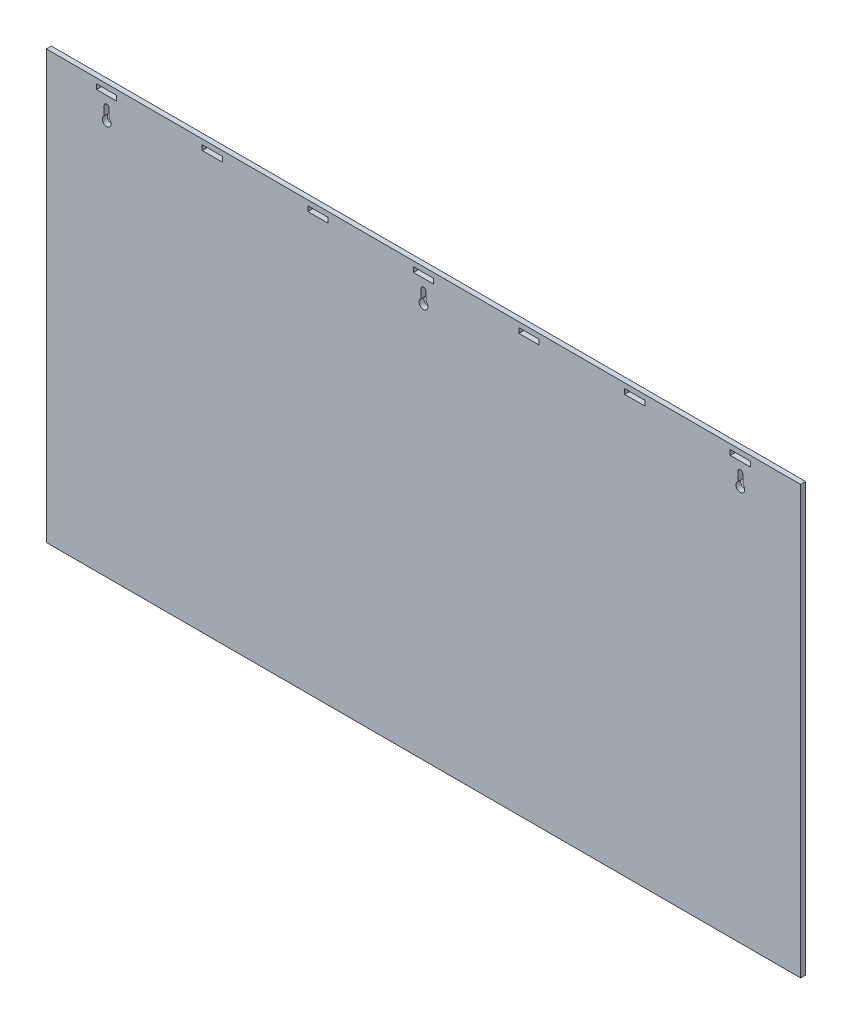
ISO-10303-21;
HEADER;
FILE_DESCRIPTION(('STEP AP214'),'2;1');
FILE_NAME('part.step','',(''),(''),'','','');
FILE_SCHEMA(('AUTOMOTIVE_DESIGN { 1 0 10303 214 1 1 1 1 }'));
ENDSEC;
DATA;
#1=APPLICATION_CONTEXT('core data for automotive mechanical design processes');
#2=APPLICATION_PROTOCOL_DEFINITION('international standard','automotive_design',2000,#1);
#3=PRODUCT_CONTEXT('',#1,'mechanical');
#4=PRODUCT('Part','Part','',(#3));
#5=PRODUCT_RELATED_PRODUCT_CATEGORY('part','',(#4));
#6=PRODUCT_DEFINITION_FORMATION('','',#4);
#7=PRODUCT_DEFINITION_CONTEXT('part definition',#1,'design');
#8=PRODUCT_DEFINITION('design','',#6,#7);
#9=PRODUCT_DEFINITION_SHAPE('','',#8);
#10=(LENGTH_UNIT() NAMED_UNIT(*) SI_UNIT(.MILLI.,.METRE.));
#11=(NAMED_UNIT(*) PLANE_ANGLE_UNIT() SI_UNIT($,.RADIAN.));
#12=(NAMED_UNIT(*) SI_UNIT($,.STERADIAN.) SOLID_ANGLE_UNIT());
#13=UNCERTAINTY_MEASURE_WITH_UNIT(LENGTH_MEASURE(1.E-05),#10,'distance_accuracy_value','');
#14=(GEOMETRIC_REPRESENTATION_CONTEXT(3) GLOBAL_UNCERTAINTY_ASSIGNED_CONTEXT((#13)) GLOBAL_UNIT_ASSIGNED_CONTEXT((#10,
#11,#12)) REPRESENTATION_CONTEXT('',''));
#15=CARTESIAN_POINT('',(0.,0.,0.));
#16=DIRECTION('',(0.,0.,1.));
#17=DIRECTION('',(1.,0.,0.));
#18=AXIS2_PLACEMENT_3D('',#15,#16,#17);
#19=CARTESIAN_POINT('',(0.,539.75,6.35));
#20=DIRECTION('',(0.,1.,0.));
#21=DIRECTION('',(0.,0.,1.));
#22=AXIS2_PLACEMENT_3D('',#19,#20,#21);
#23=PLANE('',#22);
#24=DIRECTION('',(1.,0.,0.));
#25=VECTOR('',#24,1.);
#26=CARTESIAN_POINT('',(0.,539.75,0.));
#27=LINE('',#26,#25);
#28=CARTESIAN_POINT('',(2.50423082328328E-06,539.749997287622,0.));
#29=VERTEX_POINT('',#28);
#30=CARTESIAN_POINT('',(952.5,539.75,0.));
#31=VERTEX_POINT('',#30);
#32=EDGE_CURVE('E471',#29,#31,#27,.T.);
#33=ORIENTED_EDGE('',*,*,#32,.F.);
#34=DIRECTION('',(0.,0.,-1.));
#35=VECTOR('',#34,1.);
#36=CARTESIAN_POINT('',(2.50423082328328E-06,539.749997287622,6.35));
#37=LINE('',#36,#35);
#38=CARTESIAN_POINT('',(2.50423082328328E-06,539.749997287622,6.35));
#39=VERTEX_POINT('',#38);
#40=EDGE_CURVE('E11',#39,#29,#37,.T.);
#41=ORIENTED_EDGE('',*,*,#40,.F.);
#42=DIRECTION('',(1.,0.,0.));
#43=VECTOR('',#42,1.);
#44=CARTESIAN_POINT('',(0.,539.75,6.35));
#45=LINE('',#44,#43);
#46=CARTESIAN_POINT('',(952.5,539.75,6.35));
#47=VERTEX_POINT('',#46);
#48=EDGE_CURVE('E343',#39,#47,#45,.T.);
#49=ORIENTED_EDGE('',*,*,#48,.T.);
#50=DIRECTION('',(0.,0.,-1.));
#51=VECTOR('',#50,1.);
#52=CARTESIAN_POINT('',(952.5,539.75,6.35));
#53=LINE('',#52,#51);
#54=EDGE_CURVE('E197',#47,#31,#53,.T.);
#55=ORIENTED_EDGE('',*,*,#54,.T.);
#56=EDGE_LOOP('',(#33,#41,#49,#55));
#57=FACE_BOUND('',#56,.T.);
#58=ADVANCED_FACE('F35',(#57),#23,.T.);
#59=CARTESIAN_POINT('',(0.,0.,6.35));
#60=DIRECTION('',(-1.,0.,0.));
#61=DIRECTION('',(0.,0.,1.));
#62=AXIS2_PLACEMENT_3D('',#59,#60,#61);
#63=PLANE('',#62);
#64=DIRECTION('',(0.,1.,0.));
#65=VECTOR('',#64,1.);
#66=CARTESIAN_POINT('',(0.,0.,0.));
#67=LINE('',#66,#65);
#68=CARTESIAN_POINT('',(0.,0.,0.));
#69=VERTEX_POINT('',#68);
#70=EDGE_CURVE('E333',#69,#29,#67,.T.);
#71=ORIENTED_EDGE('',*,*,#70,.F.);
#72=DIRECTION('',(0.,0.,-1.));
#73=VECTOR('',#72,1.);
#74=CARTESIAN_POINT('',(0.,0.,6.35));
#75=LINE('',#74,#73);
#76=CARTESIAN_POINT('',(0.,0.,6.35));
#77=VERTEX_POINT('',#76);
#78=EDGE_CURVE('E45',#77,#69,#75,.T.);
#79=ORIENTED_EDGE('',*,*,#78,.F.);
#80=DIRECTION('',(0.,1.,0.));
#81=VECTOR('',#80,1.);
#82=CARTESIAN_POINT('',(0.,0.,6.35));
#83=LINE('',#82,#81);
#84=EDGE_CURVE('E331',#77,#39,#83,.T.);
#85=ORIENTED_EDGE('',*,*,#84,.T.);
#86=ORIENTED_EDGE('',*,*,#40,.T.);
#87=EDGE_LOOP('',(#71,#79,#85,#86));
#88=FACE_BOUND('',#87,.T.);
#89=ADVANCED_FACE('F329',(#88),#63,.T.);
#90=CARTESIAN_POINT('',(0.,0.,6.35));
#91=DIRECTION('',(0.,1.,0.));
#92=DIRECTION('',(0.,0.,1.));
#93=AXIS2_PLACEMENT_3D('',#90,#91,#92);
#94=PLANE('',#93);
#95=DIRECTION('',(1.,0.,0.));
#96=VECTOR('',#95,1.);
#97=CARTESIAN_POINT('',(0.,0.,0.));
#98=LINE('',#97,#96);
#99=CARTESIAN_POINT('',(952.5,0.,0.));
#100=VERTEX_POINT('',#99);
#101=EDGE_CURVE('E474',#69,#100,#98,.T.);
#102=ORIENTED_EDGE('',*,*,#101,.T.);
#103=DIRECTION('',(0.,0.,-1.));
#104=VECTOR('',#103,1.);
#105=CARTESIAN_POINT('',(952.5,0.,6.35));
#106=LINE('',#105,#104);
#107=CARTESIAN_POINT('',(952.5,0.,6.35));
#108=VERTEX_POINT('',#107);
#109=EDGE_CURVE('E336',#108,#100,#106,.T.);
#110=ORIENTED_EDGE('',*,*,#109,.F.);
#111=DIRECTION('',(1.,0.,0.));
#112=VECTOR('',#111,1.);
#113=CARTESIAN_POINT('',(0.,0.,6.35));
#114=LINE('',#113,#112);
#115=EDGE_CURVE('E339',#77,#108,#114,.T.);
#116=ORIENTED_EDGE('',*,*,#115,.F.);
#117=ORIENTED_EDGE('',*,*,#78,.T.);
#118=EDGE_LOOP('',(#102,#110,#116,#117));
#119=FACE_BOUND('',#118,.T.);
#120=ADVANCED_FACE('F340',(#119),#94,.F.);
#121=CARTESIAN_POINT('',(76.2000025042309,498.474997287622,6.35));
#122=DIRECTION('',(0.,0.,-1.));
#123=DIRECTION('',(-1.,0.,0.));
#124=AXIS2_PLACEMENT_3D('',#121,#122,#123);
#125=CYLINDRICAL_SURFACE('',#124,5.55624999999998);
#126=CARTESIAN_POINT('',(76.2000025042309,498.474997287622,0.));
#127=DIRECTION('',(0.,0.,1.));
#128=DIRECTION('',(1.,0.,0.));
#129=AXIS2_PLACEMENT_3D('',#126,#127,#128);
#130=CIRCLE('',#129,5.55624999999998);
#131=CARTESIAN_POINT('',(73.0250025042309,503.034743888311,0.));
#132=VERTEX_POINT('',#131);
#133=CARTESIAN_POINT('',(79.3750025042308,503.034743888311,0.));
#134=VERTEX_POINT('',#133);
#135=EDGE_CURVE('E459',#132,#134,#130,.T.);
#136=ORIENTED_EDGE('',*,*,#135,.F.);
#137=DIRECTION('',(0.,0.,-1.));
#138=VECTOR('',#137,1.);
#139=CARTESIAN_POINT('',(73.0250025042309,503.034743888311,6.35));
#140=LINE('',#139,#138);
#141=CARTESIAN_POINT('',(73.0250025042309,503.034743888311,6.35));
#142=VERTEX_POINT('',#141);
#143=EDGE_CURVE('E479',#142,#132,#140,.T.);
#144=ORIENTED_EDGE('',*,*,#143,.F.);
#145=CARTESIAN_POINT('',(76.2000025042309,498.474997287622,6.35));
#146=DIRECTION('',(0.,0.,1.));
#147=DIRECTION('',(1.,0.,0.));
#148=AXIS2_PLACEMENT_3D('',#145,#146,#147);
#149=CIRCLE('',#148,5.55624999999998);
#150=CARTESIAN_POINT('',(79.3750025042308,503.034743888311,6.35));
#151=VERTEX_POINT('',#150);
#152=EDGE_CURVE('E678',#142,#151,#149,.T.);
#153=ORIENTED_EDGE('',*,*,#152,.T.);
#154=DIRECTION('',(0.,0.,-1.));
#155=VECTOR('',#154,1.);
#156=CARTESIAN_POINT('',(79.3750025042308,503.034743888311,6.35));
#157=LINE('',#156,#155);
#158=EDGE_CURVE('E481',#151,#134,#157,.T.);
#159=ORIENTED_EDGE('',*,*,#158,.T.);
#160=EDGE_LOOP('',(#136,#144,#153,#159));
#161=FACE_BOUND('',#160,.T.);
#162=ADVANCED_FACE('F702',(#161),#125,.F.);
#163=CARTESIAN_POINT('',(73.0250025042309,0.,6.35));
#164=DIRECTION('',(1.,0.,0.));
#165=DIRECTION('',(0.,0.,-1.));
#166=AXIS2_PLACEMENT_3D('',#163,#164,#165);
#167=PLANE('',#166);
#168=DIRECTION('',(0.,-1.,0.));
#169=VECTOR('',#168,1.);
#170=CARTESIAN_POINT('',(73.0250025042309,0.,0.));
#171=LINE('',#170,#169);
#172=CARTESIAN_POINT('',(73.0250025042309,514.349997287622,0.));
#173=VERTEX_POINT('',#172);
#174=EDGE_CURVE('E462',#173,#132,#171,.T.);
#175=ORIENTED_EDGE('',*,*,#174,.F.);
#176=DIRECTION('',(0.,0.,-1.));
#177=VECTOR('',#176,1.);
#178=CARTESIAN_POINT('',(73.0250025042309,514.349997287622,6.35));
#179=LINE('',#178,#177);
#180=CARTESIAN_POINT('',(73.0250025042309,514.349997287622,6.35));
#181=VERTEX_POINT('',#180);
#182=EDGE_CURVE('E486',#181,#173,#179,.T.);
#183=ORIENTED_EDGE('',*,*,#182,.F.);
#184=DIRECTION('',(0.,-1.,0.));
#185=VECTOR('',#184,1.);
#186=CARTESIAN_POINT('',(73.0250025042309,0.,6.35));
#187=LINE('',#186,#185);
#188=EDGE_CURVE('E681',#181,#142,#187,.T.);
#189=ORIENTED_EDGE('',*,*,#188,.T.);
#190=ORIENTED_EDGE('',*,*,#143,.T.);
#191=EDGE_LOOP('',(#175,#183,#189,#190));
#192=FACE_BOUND('',#191,.T.);
#193=ADVANCED_FACE('F704',(#192),#167,.T.);
#194=CARTESIAN_POINT('',(76.2000025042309,514.349997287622,6.35));
#195=DIRECTION('',(0.,0.,-1.));
#196=DIRECTION('',(-1.,0.,0.));
#197=AXIS2_PLACEMENT_3D('',#194,#195,#196);
#198=CYLINDRICAL_SURFACE('',#197,3.17499999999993);
#199=CARTESIAN_POINT('',(76.2000025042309,514.349997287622,0.));
#200=DIRECTION('',(0.,0.,1.));
#201=DIRECTION('',(1.,0.,0.));
#202=AXIS2_PLACEMENT_3D('',#199,#200,#201);
#203=CIRCLE('',#202,3.17499999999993);
#204=CARTESIAN_POINT('',(79.3750025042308,514.349997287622,0.));
#205=VERTEX_POINT('',#204);
#206=EDGE_CURVE('E465',#205,#173,#203,.T.);
#207=ORIENTED_EDGE('',*,*,#206,.F.);
#208=DIRECTION('',(0.,0.,-1.));
#209=VECTOR('',#208,1.);
#210=CARTESIAN_POINT('',(79.3750025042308,514.349997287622,6.35));
#211=LINE('',#210,#209);
#212=CARTESIAN_POINT('',(79.3750025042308,514.349997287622,6.35));
#213=VERTEX_POINT('',#212);
#214=EDGE_CURVE('E483',#213,#205,#211,.T.);
#215=ORIENTED_EDGE('',*,*,#214,.F.);
#216=CARTESIAN_POINT('',(76.2000025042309,514.349997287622,6.35));
#217=DIRECTION('',(0.,0.,1.));
#218=DIRECTION('',(1.,0.,0.));
#219=AXIS2_PLACEMENT_3D('',#216,#217,#218);
#220=CIRCLE('',#219,3.17499999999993);
#221=EDGE_CURVE('E684',#213,#181,#220,.T.);
#222=ORIENTED_EDGE('',*,*,#221,.T.);
#223=ORIENTED_EDGE('',*,*,#182,.T.);
#224=EDGE_LOOP('',(#207,#215,#222,#223));
#225=FACE_BOUND('',#224,.T.);
#226=ADVANCED_FACE('F697',(#225),#198,.F.);
#227=CARTESIAN_POINT('',(476.250001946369,498.475031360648,6.35));
#228=DIRECTION('',(0.,0.,-1.));
#229=DIRECTION('',(-1.,0.,0.));
#230=AXIS2_PLACEMENT_3D('',#227,#228,#229);
#231=CYLINDRICAL_SURFACE('',#230,5.55624999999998);
#232=CARTESIAN_POINT('',(476.250001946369,498.475031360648,0.));
#233=DIRECTION('',(0.,0.,1.));
#234=DIRECTION('',(1.,0.,0.));
#235=AXIS2_PLACEMENT_3D('',#232,#233,#234);
#236=CIRCLE('',#235,5.55624999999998);
#237=CARTESIAN_POINT('',(473.075001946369,503.034777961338,0.));
#238=VERTEX_POINT('',#237);
#239=CARTESIAN_POINT('',(479.425001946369,503.034777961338,0.));
#240=VERTEX_POINT('',#239);
#241=EDGE_CURVE('E447',#238,#240,#236,.T.);
#242=ORIENTED_EDGE('',*,*,#241,.F.);
#243=DIRECTION('',(0.,0.,-1.));
#244=VECTOR('',#243,1.);
#245=CARTESIAN_POINT('',(473.075001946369,503.034777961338,6.35));
#246=LINE('',#245,#244);
#247=CARTESIAN_POINT('',(473.075001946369,503.034777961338,6.35));
#248=VERTEX_POINT('',#247);
#249=EDGE_CURVE('E484',#248,#238,#246,.T.);
#250=ORIENTED_EDGE('',*,*,#249,.F.);
#251=CARTESIAN_POINT('',(476.250001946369,498.475031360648,6.35));
#252=DIRECTION('',(0.,0.,1.));
#253=DIRECTION('',(1.,0.,0.));
#254=AXIS2_PLACEMENT_3D('',#251,#252,#253);
#255=CIRCLE('',#254,5.55624999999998);
#256=CARTESIAN_POINT('',(479.425001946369,503.034777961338,6.35));
#257=VERTEX_POINT('',#256);
#258=EDGE_CURVE('E666',#248,#257,#255,.T.);
#259=ORIENTED_EDGE('',*,*,#258,.T.);
#260=DIRECTION('',(0.,0.,-1.));
#261=VECTOR('',#260,1.);
#262=CARTESIAN_POINT('',(479.425001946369,503.034777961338,6.35));
#263=LINE('',#262,#261);
#264=EDGE_CURVE('E489',#257,#240,#263,.T.);
#265=ORIENTED_EDGE('',*,*,#264,.T.);
#266=EDGE_LOOP('',(#242,#250,#259,#265));
#267=FACE_BOUND('',#266,.T.);
#268=ADVANCED_FACE('F711',(#267),#231,.F.);
#269=CARTESIAN_POINT('',(473.075001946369,0.,6.35));
#270=DIRECTION('',(1.,0.,0.));
#271=DIRECTION('',(0.,0.,-1.));
#272=AXIS2_PLACEMENT_3D('',#269,#270,#271);
#273=PLANE('',#272);
#274=DIRECTION('',(0.,-1.,0.));
#275=VECTOR('',#274,1.);
#276=CARTESIAN_POINT('',(473.075001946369,0.,0.));
#277=LINE('',#276,#275);
#278=CARTESIAN_POINT('',(473.075001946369,514.350031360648,0.));
#279=VERTEX_POINT('',#278);
#280=EDGE_CURVE('E450',#279,#238,#277,.T.);
#281=ORIENTED_EDGE('',*,*,#280,.F.);
#282=DIRECTION('',(0.,0.,-1.));
#283=VECTOR('',#282,1.);
#284=CARTESIAN_POINT('',(473.075001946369,514.350031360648,6.35));
#285=LINE('',#284,#283);
#286=CARTESIAN_POINT('',(473.075001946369,514.350031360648,6.35));
#287=VERTEX_POINT('',#286);
#288=EDGE_CURVE('E494',#287,#279,#285,.T.);
#289=ORIENTED_EDGE('',*,*,#288,.F.);
#290=DIRECTION('',(0.,-1.,0.));
#291=VECTOR('',#290,1.);
#292=CARTESIAN_POINT('',(473.075001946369,0.,6.35));
#293=LINE('',#292,#291);
#294=EDGE_CURVE('E669',#287,#248,#293,.T.);
#295=ORIENTED_EDGE('',*,*,#294,.T.);
#296=ORIENTED_EDGE('',*,*,#249,.T.);
#297=EDGE_LOOP('',(#281,#289,#295,#296));
#298=FACE_BOUND('',#297,.T.);
#299=ADVANCED_FACE('F853',(#298),#273,.T.);
#300=CARTESIAN_POINT('',(476.250001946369,514.350031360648,6.35));
#301=DIRECTION('',(0.,0.,-1.));
#302=DIRECTION('',(-1.,0.,0.));
#303=AXIS2_PLACEMENT_3D('',#300,#301,#302);
#304=CYLINDRICAL_SURFACE('',#303,3.17499999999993);
#305=CARTESIAN_POINT('',(476.250001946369,514.350031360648,0.));
#306=DIRECTION('',(0.,0.,1.));
#307=DIRECTION('',(1.,0.,0.));
#308=AXIS2_PLACEMENT_3D('',#305,#306,#307);
#309=CIRCLE('',#308,3.17499999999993);
#310=CARTESIAN_POINT('',(479.425001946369,514.350031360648,0.));
#311=VERTEX_POINT('',#310);
#312=EDGE_CURVE('E453',#311,#279,#309,.T.);
#313=ORIENTED_EDGE('',*,*,#312,.F.);
#314=DIRECTION('',(0.,0.,-1.));
#315=VECTOR('',#314,1.);
#316=CARTESIAN_POINT('',(479.425001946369,514.350031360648,6.35));
#317=LINE('',#316,#315);
#318=CARTESIAN_POINT('',(479.425001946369,514.350031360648,6.35));
#319=VERTEX_POINT('',#318);
#320=EDGE_CURVE('E491',#319,#311,#317,.T.);
#321=ORIENTED_EDGE('',*,*,#320,.F.);
#322=CARTESIAN_POINT('',(476.250001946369,514.350031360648,6.35));
#323=DIRECTION('',(0.,0.,1.));
#324=DIRECTION('',(1.,0.,0.));
#325=AXIS2_PLACEMENT_3D('',#322,#323,#324);
#326=CIRCLE('',#325,3.17499999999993);
#327=EDGE_CURVE('E672',#319,#287,#326,.T.);
#328=ORIENTED_EDGE('',*,*,#327,.T.);
#329=ORIENTED_EDGE('',*,*,#288,.T.);
#330=EDGE_LOOP('',(#313,#321,#328,#329));
#331=FACE_BOUND('',#330,.T.);
#332=ADVANCED_FACE('F840',(#331),#304,.F.);
#333=CARTESIAN_POINT('',(876.299985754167,498.474870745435,6.35));
#334=DIRECTION('',(0.,0.,-1.));
#335=DIRECTION('',(-1.,0.,0.));
#336=AXIS2_PLACEMENT_3D('',#333,#334,#335);
#337=CYLINDRICAL_SURFACE('',#336,5.55624999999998);
#338=CARTESIAN_POINT('',(876.299985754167,498.474870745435,0.));
#339=DIRECTION('',(0.,0.,1.));
#340=DIRECTION('',(1.,0.,0.));
#341=AXIS2_PLACEMENT_3D('',#338,#339,#340);
#342=CIRCLE('',#341,5.55624999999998);
#343=CARTESIAN_POINT('',(873.124985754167,503.034617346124,0.));
#344=VERTEX_POINT('',#343);
#345=CARTESIAN_POINT('',(879.474985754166,503.034617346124,0.));
#346=VERTEX_POINT('',#345);
#347=EDGE_CURVE('E435',#344,#346,#342,.T.);
#348=ORIENTED_EDGE('',*,*,#347,.F.);
#349=DIRECTION('',(0.,0.,-1.));
#350=VECTOR('',#349,1.);
#351=CARTESIAN_POINT('',(873.124985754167,503.034617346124,6.35));
#352=LINE('',#351,#350);
#353=CARTESIAN_POINT('',(873.124985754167,503.034617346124,6.35));
#354=VERTEX_POINT('',#353);
#355=EDGE_CURVE('E492',#354,#344,#352,.T.);
#356=ORIENTED_EDGE('',*,*,#355,.F.);
#357=CARTESIAN_POINT('',(876.299985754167,498.474870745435,6.35));
#358=DIRECTION('',(0.,0.,1.));
#359=DIRECTION('',(1.,0.,0.));
#360=AXIS2_PLACEMENT_3D('',#357,#358,#359);
#361=CIRCLE('',#360,5.55624999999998);
#362=CARTESIAN_POINT('',(879.474985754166,503.034617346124,6.35));
#363=VERTEX_POINT('',#362);
#364=EDGE_CURVE('E654',#354,#363,#361,.T.);
#365=ORIENTED_EDGE('',*,*,#364,.T.);
#366=DIRECTION('',(0.,0.,-1.));
#367=VECTOR('',#366,1.);
#368=CARTESIAN_POINT('',(879.474985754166,503.034617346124,6.35));
#369=LINE('',#368,#367);
#370=EDGE_CURVE('E497',#363,#346,#369,.T.);
#371=ORIENTED_EDGE('',*,*,#370,.T.);
#372=EDGE_LOOP('',(#348,#356,#365,#371));
#373=FACE_BOUND('',#372,.T.);
#374=ADVANCED_FACE('F836',(#373),#337,.F.);
#375=CARTESIAN_POINT('',(873.124985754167,0.,6.35));
#376=DIRECTION('',(1.,0.,0.));
#377=DIRECTION('',(0.,0.,-1.));
#378=AXIS2_PLACEMENT_3D('',#375,#376,#377);
#379=PLANE('',#378);
#380=DIRECTION('',(0.,-1.,0.));
#381=VECTOR('',#380,1.);
#382=CARTESIAN_POINT('',(873.124985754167,0.,0.));
#383=LINE('',#382,#381);
#384=CARTESIAN_POINT('',(873.124985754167,514.349870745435,0.));
#385=VERTEX_POINT('',#384);
#386=EDGE_CURVE('E438',#385,#344,#383,.T.);
#387=ORIENTED_EDGE('',*,*,#386,.F.);
#388=DIRECTION('',(0.,0.,-1.));
#389=VECTOR('',#388,1.);
#390=CARTESIAN_POINT('',(873.124985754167,514.349870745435,6.35));
#391=LINE('',#390,#389);
#392=CARTESIAN_POINT('',(873.124985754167,514.349870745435,6.35));
#393=VERTEX_POINT('',#392);
#394=EDGE_CURVE('E502',#393,#385,#391,.T.);
#395=ORIENTED_EDGE('',*,*,#394,.F.);
#396=DIRECTION('',(0.,-1.,0.));
#397=VECTOR('',#396,1.);
#398=CARTESIAN_POINT('',(873.124985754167,0.,6.35));
#399=LINE('',#398,#397);
#400=EDGE_CURVE('E657',#393,#354,#399,.T.);
#401=ORIENTED_EDGE('',*,*,#400,.T.);
#402=ORIENTED_EDGE('',*,*,#355,.T.);
#403=EDGE_LOOP('',(#387,#395,#401,#402));
#404=FACE_BOUND('',#403,.T.);
#405=ADVANCED_FACE('F839',(#404),#379,.T.);
#406=CARTESIAN_POINT('',(876.299985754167,514.349870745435,6.35));
#407=DIRECTION('',(0.,0.,-1.));
#408=DIRECTION('',(-1.,0.,0.));
#409=AXIS2_PLACEMENT_3D('',#406,#407,#408);
#410=CYLINDRICAL_SURFACE('',#409,3.17499999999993);
#411=CARTESIAN_POINT('',(876.299985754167,514.349870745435,0.));
#412=DIRECTION('',(0.,0.,1.));
#413=DIRECTION('',(1.,0.,0.));
#414=AXIS2_PLACEMENT_3D('',#411,#412,#413);
#415=CIRCLE('',#414,3.17499999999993);
#416=CARTESIAN_POINT('',(879.474985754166,514.349870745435,0.));
#417=VERTEX_POINT('',#416);
#418=EDGE_CURVE('E441',#417,#385,#415,.T.);
#419=ORIENTED_EDGE('',*,*,#418,.F.);
#420=DIRECTION('',(0.,0.,-1.));
#421=VECTOR('',#420,1.);
#422=CARTESIAN_POINT('',(879.474985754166,514.349870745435,6.35));
#423=LINE('',#422,#421);
#424=CARTESIAN_POINT('',(879.474985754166,514.349870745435,6.35));
#425=VERTEX_POINT('',#424);
#426=EDGE_CURVE('E499',#425,#417,#423,.T.);
#427=ORIENTED_EDGE('',*,*,#426,.F.);
#428=CARTESIAN_POINT('',(876.299985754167,514.349870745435,6.35));
#429=DIRECTION('',(0.,0.,1.));
#430=DIRECTION('',(1.,0.,0.));
#431=AXIS2_PLACEMENT_3D('',#428,#429,#430);
#432=CIRCLE('',#431,3.17499999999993);
#433=EDGE_CURVE('E660',#425,#393,#432,.T.);
#434=ORIENTED_EDGE('',*,*,#433,.T.);
#435=ORIENTED_EDGE('',*,*,#394,.T.);
#436=EDGE_LOOP('',(#419,#427,#434,#435));
#437=FACE_BOUND('',#436,.T.);
#438=ADVANCED_FACE('F825',(#437),#410,.F.);
#439=CARTESIAN_POINT('',(63.5000025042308,0.,6.35));
#440=DIRECTION('',(1.,0.,0.));
#441=DIRECTION('',(0.,0.,-1.));
#442=AXIS2_PLACEMENT_3D('',#439,#440,#441);
#443=PLANE('',#442);
#444=DIRECTION('',(0.,-1.,0.));
#445=VECTOR('',#444,1.);
#446=CARTESIAN_POINT('',(63.5000025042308,0.,0.));
#447=LINE('',#446,#445);
#448=CARTESIAN_POINT('',(63.5000025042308,533.399997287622,0.));
#449=VERTEX_POINT('',#448);
#450=CARTESIAN_POINT('',(63.5000025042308,527.049997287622,0.));
#451=VERTEX_POINT('',#450);
#452=EDGE_CURVE('E423',#449,#451,#447,.T.);
#453=ORIENTED_EDGE('',*,*,#452,.F.);
#454=DIRECTION('',(0.,0.,-1.));
#455=VECTOR('',#454,1.);
#456=CARTESIAN_POINT('',(63.5000025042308,533.399997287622,6.35));
#457=LINE('',#456,#455);
#458=CARTESIAN_POINT('',(63.5000025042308,533.399997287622,6.35));
#459=VERTEX_POINT('',#458);
#460=EDGE_CURVE('E500',#459,#449,#457,.T.);
#461=ORIENTED_EDGE('',*,*,#460,.F.);
#462=DIRECTION('',(0.,-1.,0.));
#463=VECTOR('',#462,1.);
#464=CARTESIAN_POINT('',(63.5000025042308,0.,6.35));
#465=LINE('',#464,#463);
#466=CARTESIAN_POINT('',(63.5000025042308,527.049997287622,6.35));
#467=VERTEX_POINT('',#466);
#468=EDGE_CURVE('E643',#459,#467,#465,.T.);
#469=ORIENTED_EDGE('',*,*,#468,.T.);
#470=DIRECTION('',(0.,0.,-1.));
#471=VECTOR('',#470,1.);
#472=CARTESIAN_POINT('',(63.5000025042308,527.049997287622,6.35));
#473=LINE('',#472,#471);
#474=EDGE_CURVE('E505',#467,#451,#473,.T.);
#475=ORIENTED_EDGE('',*,*,#474,.T.);
#476=EDGE_LOOP('',(#453,#461,#469,#475));
#477=FACE_BOUND('',#476,.T.);
#478=ADVANCED_FACE('F821',(#477),#443,.T.);
#479=CARTESIAN_POINT('',(0.,533.399997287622,6.35));
#480=DIRECTION('',(0.,1.,0.));
#481=DIRECTION('',(0.,0.,1.));
#482=AXIS2_PLACEMENT_3D('',#479,#480,#481);
#483=PLANE('',#482);
#484=DIRECTION('',(1.,0.,0.));
#485=VECTOR('',#484,1.);
#486=CARTESIAN_POINT('',(0.,533.399997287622,0.));
#487=LINE('',#486,#485);
#488=CARTESIAN_POINT('',(88.9000025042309,533.399997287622,0.));
#489=VERTEX_POINT('',#488);
#490=EDGE_CURVE('E426',#449,#489,#487,.T.);
#491=ORIENTED_EDGE('',*,*,#490,.T.);
#492=DIRECTION('',(0.,0.,-1.));
#493=VECTOR('',#492,1.);
#494=CARTESIAN_POINT('',(88.9000025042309,533.399997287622,6.35));
#495=LINE('',#494,#493);
#496=CARTESIAN_POINT('',(88.9000025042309,533.399997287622,6.35));
#497=VERTEX_POINT('',#496);
#498=EDGE_CURVE('E510',#497,#489,#495,.T.);
#499=ORIENTED_EDGE('',*,*,#498,.F.);
#500=DIRECTION('',(1.,0.,0.));
#501=VECTOR('',#500,1.);
#502=CARTESIAN_POINT('',(0.,533.399997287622,6.35));
#503=LINE('',#502,#501);
#504=EDGE_CURVE('E646',#459,#497,#503,.T.);
#505=ORIENTED_EDGE('',*,*,#504,.F.);
#506=ORIENTED_EDGE('',*,*,#460,.T.);
#507=EDGE_LOOP('',(#491,#499,#505,#506));
#508=FACE_BOUND('',#507,.T.);
#509=ADVANCED_FACE('F824',(#508),#483,.F.);
#510=CARTESIAN_POINT('',(88.9000025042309,0.,6.35));
#511=DIRECTION('',(1.,0.,0.));
#512=DIRECTION('',(0.,0.,-1.));
#513=AXIS2_PLACEMENT_3D('',#510,#511,#512);
#514=PLANE('',#513);
#515=DIRECTION('',(0.,-1.,0.));
#516=VECTOR('',#515,1.);
#517=CARTESIAN_POINT('',(88.9000025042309,0.,0.));
#518=LINE('',#517,#516);
#519=CARTESIAN_POINT('',(88.9000025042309,527.049997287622,0.));
#520=VERTEX_POINT('',#519);
#521=EDGE_CURVE('E429',#489,#520,#518,.T.);
#522=ORIENTED_EDGE('',*,*,#521,.T.);
#523=DIRECTION('',(0.,0.,-1.));
#524=VECTOR('',#523,1.);
#525=CARTESIAN_POINT('',(88.9000025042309,527.049997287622,6.35));
#526=LINE('',#525,#524);
#527=CARTESIAN_POINT('',(88.9000025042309,527.049997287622,6.35));
#528=VERTEX_POINT('',#527);
#529=EDGE_CURVE('E507',#528,#520,#526,.T.);
#530=ORIENTED_EDGE('',*,*,#529,.F.);
#531=DIRECTION('',(0.,-1.,0.));
#532=VECTOR('',#531,1.);
#533=CARTESIAN_POINT('',(88.9000025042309,0.,6.35));
#534=LINE('',#533,#532);
#535=EDGE_CURVE('E649',#497,#528,#534,.T.);
#536=ORIENTED_EDGE('',*,*,#535,.F.);
#537=ORIENTED_EDGE('',*,*,#498,.T.);
#538=EDGE_LOOP('',(#522,#530,#536,#537));
#539=FACE_BOUND('',#538,.T.);
#540=ADVANCED_FACE('F809',(#539),#514,.F.);
#541=CARTESIAN_POINT('',(196.850002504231,0.,6.35));
#542=DIRECTION('',(1.,0.,0.));
#543=DIRECTION('',(0.,0.,-1.));
#544=AXIS2_PLACEMENT_3D('',#541,#542,#543);
#545=PLANE('',#544);
#546=DIRECTION('',(0.,-1.,0.));
#547=VECTOR('',#546,1.);
#548=CARTESIAN_POINT('',(196.850002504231,0.,0.));
#549=LINE('',#548,#547);
#550=CARTESIAN_POINT('',(196.850002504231,533.399997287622,0.));
#551=VERTEX_POINT('',#550);
#552=CARTESIAN_POINT('',(196.850002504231,527.049997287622,0.));
#553=VERTEX_POINT('',#552);
#554=EDGE_CURVE('E411',#551,#553,#549,.T.);
#555=ORIENTED_EDGE('',*,*,#554,.F.);
#556=DIRECTION('',(0.,0.,-1.));
#557=VECTOR('',#556,1.);
#558=CARTESIAN_POINT('',(196.850002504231,533.399997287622,6.35));
#559=LINE('',#558,#557);
#560=CARTESIAN_POINT('',(196.850002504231,533.399997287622,6.35));
#561=VERTEX_POINT('',#560);
#562=EDGE_CURVE('E508',#561,#551,#559,.T.);
#563=ORIENTED_EDGE('',*,*,#562,.F.);
#564=DIRECTION('',(0.,-1.,0.));
#565=VECTOR('',#564,1.);
#566=CARTESIAN_POINT('',(196.850002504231,0.,6.35));
#567=LINE('',#566,#565);
#568=CARTESIAN_POINT('',(196.850002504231,527.049997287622,6.35));
#569=VERTEX_POINT('',#568);
#570=EDGE_CURVE('E631',#561,#569,#567,.T.);
#571=ORIENTED_EDGE('',*,*,#570,.T.);
#572=DIRECTION('',(0.,0.,-1.));
#573=VECTOR('',#572,1.);
#574=CARTESIAN_POINT('',(196.850002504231,527.049997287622,6.35));
#575=LINE('',#574,#573);
#576=EDGE_CURVE('E514',#569,#553,#575,.T.);
#577=ORIENTED_EDGE('',*,*,#576,.T.);
#578=EDGE_LOOP('',(#555,#563,#571,#577));
#579=FACE_BOUND('',#578,.T.);
#580=ADVANCED_FACE('F805',(#579),#545,.T.);
#581=CARTESIAN_POINT('',(0.,533.399997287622,6.35));
#582=DIRECTION('',(0.,-1.,0.));
#583=DIRECTION('',(0.,0.,-1.));
#584=AXIS2_PLACEMENT_3D('',#581,#582,#583);
#585=PLANE('',#584);
#586=DIRECTION('',(-1.,0.,0.));
#587=VECTOR('',#586,1.);
#588=CARTESIAN_POINT('',(0.,533.399997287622,0.));
#589=LINE('',#588,#587);
#590=CARTESIAN_POINT('',(222.250002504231,533.399997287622,0.));
#591=VERTEX_POINT('',#590);
#592=EDGE_CURVE('E414',#591,#551,#589,.T.);
#593=ORIENTED_EDGE('',*,*,#592,.F.);
#594=DIRECTION('',(0.,0.,-1.));
#595=VECTOR('',#594,1.);
#596=CARTESIAN_POINT('',(222.250002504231,533.399997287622,6.35));
#597=LINE('',#596,#595);
#598=CARTESIAN_POINT('',(222.250002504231,533.399997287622,6.35));
#599=VERTEX_POINT('',#598);
#600=EDGE_CURVE('E519',#599,#591,#597,.T.);
#601=ORIENTED_EDGE('',*,*,#600,.F.);
#602=DIRECTION('',(-1.,0.,0.));
#603=VECTOR('',#602,1.);
#604=CARTESIAN_POINT('',(0.,533.399997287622,6.35));
#605=LINE('',#604,#603);
#606=EDGE_CURVE('E634',#599,#561,#605,.T.);
#607=ORIENTED_EDGE('',*,*,#606,.T.);
#608=ORIENTED_EDGE('',*,*,#562,.T.);
#609=EDGE_LOOP('',(#593,#601,#607,#608));
#610=FACE_BOUND('',#609,.T.);
#611=ADVANCED_FACE('F808',(#610),#585,.T.);
#612=CARTESIAN_POINT('',(222.250002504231,0.,6.35));
#613=DIRECTION('',(-1.,0.,0.));
#614=DIRECTION('',(0.,0.,1.));
#615=AXIS2_PLACEMENT_3D('',#612,#613,#614);
#616=PLANE('',#615);
#617=DIRECTION('',(0.,1.,0.));
#618=VECTOR('',#617,1.);
#619=CARTESIAN_POINT('',(222.250002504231,0.,0.));
#620=LINE('',#619,#618);
#621=CARTESIAN_POINT('',(222.250002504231,527.049997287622,0.));
#622=VERTEX_POINT('',#621);
#623=EDGE_CURVE('E417',#622,#591,#620,.T.);
#624=ORIENTED_EDGE('',*,*,#623,.F.);
#625=DIRECTION('',(0.,0.,-1.));
#626=VECTOR('',#625,1.);
#627=CARTESIAN_POINT('',(222.250002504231,527.049997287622,6.35));
#628=LINE('',#627,#626);
#629=CARTESIAN_POINT('',(222.250002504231,527.049997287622,6.35));
#630=VERTEX_POINT('',#629);
#631=EDGE_CURVE('E516',#630,#622,#628,.T.);
#632=ORIENTED_EDGE('',*,*,#631,.F.);
#633=DIRECTION('',(0.,1.,0.));
#634=VECTOR('',#633,1.);
#635=CARTESIAN_POINT('',(222.250002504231,0.,6.35));
#636=LINE('',#635,#634);
#637=EDGE_CURVE('E637',#630,#599,#636,.T.);
#638=ORIENTED_EDGE('',*,*,#637,.T.);
#639=ORIENTED_EDGE('',*,*,#600,.T.);
#640=EDGE_LOOP('',(#624,#632,#638,#639));
#641=FACE_BOUND('',#640,.T.);
#642=ADVANCED_FACE('F793',(#641),#616,.T.);
#643=CARTESIAN_POINT('',(330.200002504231,0.,6.35));
#644=DIRECTION('',(1.,0.,0.));
#645=DIRECTION('',(0.,0.,-1.));
#646=AXIS2_PLACEMENT_3D('',#643,#644,#645);
#647=PLANE('',#646);
#648=DIRECTION('',(0.,-1.,0.));
#649=VECTOR('',#648,1.);
#650=CARTESIAN_POINT('',(330.200002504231,0.,0.));
#651=LINE('',#650,#649);
#652=CARTESIAN_POINT('',(330.200002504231,533.399997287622,0.));
#653=VERTEX_POINT('',#652);
#654=CARTESIAN_POINT('',(330.200002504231,527.049997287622,0.));
#655=VERTEX_POINT('',#654);
#656=EDGE_CURVE('E399',#653,#655,#651,.T.);
#657=ORIENTED_EDGE('',*,*,#656,.F.);
#658=DIRECTION('',(0.,0.,-1.));
#659=VECTOR('',#658,1.);
#660=CARTESIAN_POINT('',(330.200002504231,533.399997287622,6.35));
#661=LINE('',#660,#659);
#662=CARTESIAN_POINT('',(330.200002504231,533.399997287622,6.35));
#663=VERTEX_POINT('',#662);
#664=EDGE_CURVE('E517',#663,#653,#661,.T.);
#665=ORIENTED_EDGE('',*,*,#664,.F.);
#666=DIRECTION('',(0.,-1.,0.));
#667=VECTOR('',#666,1.);
#668=CARTESIAN_POINT('',(330.200002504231,0.,6.35));
#669=LINE('',#668,#667);
#670=CARTESIAN_POINT('',(330.200002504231,527.049997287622,6.35));
#671=VERTEX_POINT('',#670);
#672=EDGE_CURVE('E619',#663,#671,#669,.T.);
#673=ORIENTED_EDGE('',*,*,#672,.T.);
#674=DIRECTION('',(0.,0.,-1.));
#675=VECTOR('',#674,1.);
#676=CARTESIAN_POINT('',(330.200002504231,527.049997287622,6.35));
#677=LINE('',#676,#675);
#678=EDGE_CURVE('E522',#671,#655,#677,.T.);
#679=ORIENTED_EDGE('',*,*,#678,.T.);
#680=EDGE_LOOP('',(#657,#665,#673,#679));
#681=FACE_BOUND('',#680,.T.);
#682=ADVANCED_FACE('F789',(#681),#647,.T.);
#683=CARTESIAN_POINT('',(0.,533.399997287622,6.35));
#684=DIRECTION('',(0.,-1.,0.));
#685=DIRECTION('',(0.,0.,-1.));
#686=AXIS2_PLACEMENT_3D('',#683,#684,#685);
#687=PLANE('',#686);
#688=DIRECTION('',(-1.,0.,0.));
#689=VECTOR('',#688,1.);
#690=CARTESIAN_POINT('',(0.,533.399997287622,0.));
#691=LINE('',#690,#689);
#692=CARTESIAN_POINT('',(355.600002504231,533.399997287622,0.));
#693=VERTEX_POINT('',#692);
#694=EDGE_CURVE('E402',#693,#653,#691,.T.);
#695=ORIENTED_EDGE('',*,*,#694,.F.);
#696=DIRECTION('',(0.,0.,-1.));
#697=VECTOR('',#696,1.);
#698=CARTESIAN_POINT('',(355.600002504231,533.399997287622,6.35));
#699=LINE('',#698,#697);
#700=CARTESIAN_POINT('',(355.600002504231,533.399997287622,6.35));
#701=VERTEX_POINT('',#700);
#702=EDGE_CURVE('E527',#701,#693,#699,.T.);
#703=ORIENTED_EDGE('',*,*,#702,.F.);
#704=DIRECTION('',(-1.,0.,0.));
#705=VECTOR('',#704,1.);
#706=CARTESIAN_POINT('',(0.,533.399997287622,6.35));
#707=LINE('',#706,#705);
#708=EDGE_CURVE('E622',#701,#663,#707,.T.);
#709=ORIENTED_EDGE('',*,*,#708,.T.);
#710=ORIENTED_EDGE('',*,*,#664,.T.);
#711=EDGE_LOOP('',(#695,#703,#709,#710));
#712=FACE_BOUND('',#711,.T.);
#713=ADVANCED_FACE('F792',(#712),#687,.T.);
#714=CARTESIAN_POINT('',(355.600002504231,0.,6.35));
#715=DIRECTION('',(-1.,0.,0.));
#716=DIRECTION('',(0.,0.,1.));
#717=AXIS2_PLACEMENT_3D('',#714,#715,#716);
#718=PLANE('',#717);
#719=DIRECTION('',(0.,1.,0.));
#720=VECTOR('',#719,1.);
#721=CARTESIAN_POINT('',(355.600002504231,0.,0.));
#722=LINE('',#721,#720);
#723=CARTESIAN_POINT('',(355.600002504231,527.049997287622,0.));
#724=VERTEX_POINT('',#723);
#725=EDGE_CURVE('E405',#724,#693,#722,.T.);
#726=ORIENTED_EDGE('',*,*,#725,.F.);
#727=DIRECTION('',(0.,0.,-1.));
#728=VECTOR('',#727,1.);
#729=CARTESIAN_POINT('',(355.600002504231,527.049997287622,6.35));
#730=LINE('',#729,#728);
#731=CARTESIAN_POINT('',(355.600002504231,527.049997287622,6.35));
#732=VERTEX_POINT('',#731);
#733=EDGE_CURVE('E524',#732,#724,#730,.T.);
#734=ORIENTED_EDGE('',*,*,#733,.F.);
#735=DIRECTION('',(0.,1.,0.));
#736=VECTOR('',#735,1.);
#737=CARTESIAN_POINT('',(355.600002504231,0.,6.35));
#738=LINE('',#737,#736);
#739=EDGE_CURVE('E625',#732,#701,#738,.T.);
#740=ORIENTED_EDGE('',*,*,#739,.T.);
#741=ORIENTED_EDGE('',*,*,#702,.T.);
#742=EDGE_LOOP('',(#726,#734,#740,#741));
#743=FACE_BOUND('',#742,.T.);
#744=ADVANCED_FACE('F777',(#743),#718,.T.);
#745=CARTESIAN_POINT('',(463.550002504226,-4.05231406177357E-12,6.35));
#746=DIRECTION('',(1.,0.,0.));
#747=DIRECTION('',(0.,1.,0.));
#748=AXIS2_PLACEMENT_3D('',#745,#746,#747);
#749=PLANE('',#748);
#750=DIRECTION('',(0.,-1.,0.));
#751=VECTOR('',#750,1.);
#752=CARTESIAN_POINT('',(463.550002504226,-4.05231406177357E-12,0.));
#753=LINE('',#752,#751);
#754=CARTESIAN_POINT('',(463.550002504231,533.399997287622,0.));
#755=VERTEX_POINT('',#754);
#756=CARTESIAN_POINT('',(463.550002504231,527.049997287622,0.));
#757=VERTEX_POINT('',#756);
#758=EDGE_CURVE('E387',#755,#757,#753,.T.);
#759=ORIENTED_EDGE('',*,*,#758,.F.);
#760=DIRECTION('',(0.,0.,-1.));
#761=VECTOR('',#760,1.);
#762=CARTESIAN_POINT('',(463.550002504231,533.399997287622,6.35));
#763=LINE('',#762,#761);
#764=CARTESIAN_POINT('',(463.550002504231,533.399997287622,6.35));
#765=VERTEX_POINT('',#764);
#766=EDGE_CURVE('E525',#765,#755,#763,.T.);
#767=ORIENTED_EDGE('',*,*,#766,.F.);
#768=DIRECTION('',(0.,-1.,0.));
#769=VECTOR('',#768,1.);
#770=CARTESIAN_POINT('',(463.550002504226,-4.05231406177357E-12,6.35));
#771=LINE('',#770,#769);
#772=CARTESIAN_POINT('',(463.550002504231,527.049997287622,6.35));
#773=VERTEX_POINT('',#772);
#774=EDGE_CURVE('E607',#765,#773,#771,.T.);
#775=ORIENTED_EDGE('',*,*,#774,.T.);
#776=DIRECTION('',(0.,0.,-1.));
#777=VECTOR('',#776,1.);
#778=CARTESIAN_POINT('',(463.550002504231,527.049997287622,6.35));
#779=LINE('',#778,#777);
#780=EDGE_CURVE('E530',#773,#757,#779,.T.);
#781=ORIENTED_EDGE('',*,*,#780,.T.);
#782=EDGE_LOOP('',(#759,#767,#775,#781));
#783=FACE_BOUND('',#782,.T.);
#784=ADVANCED_FACE('F773',(#783),#749,.T.);
#785=CARTESIAN_POINT('',(0.,533.399997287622,6.35));
#786=DIRECTION('',(0.,-1.,0.));
#787=DIRECTION('',(0.,0.,-1.));
#788=AXIS2_PLACEMENT_3D('',#785,#786,#787);
#789=PLANE('',#788);
#790=DIRECTION('',(-1.,0.,0.));
#791=VECTOR('',#790,1.);
#792=CARTESIAN_POINT('',(0.,533.399997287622,0.));
#793=LINE('',#792,#791);
#794=CARTESIAN_POINT('',(488.95000250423,533.399997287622,0.));
#795=VERTEX_POINT('',#794);
#796=EDGE_CURVE('E390',#795,#755,#793,.T.);
#797=ORIENTED_EDGE('',*,*,#796,.F.);
#798=DIRECTION('',(0.,0.,-1.));
#799=VECTOR('',#798,1.);
#800=CARTESIAN_POINT('',(488.95000250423,533.399997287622,6.35));
#801=LINE('',#800,#799);
#802=CARTESIAN_POINT('',(488.95000250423,533.399997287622,6.35));
#803=VERTEX_POINT('',#802);
#804=EDGE_CURVE('E535',#803,#795,#801,.T.);
#805=ORIENTED_EDGE('',*,*,#804,.F.);
#806=DIRECTION('',(-1.,0.,0.));
#807=VECTOR('',#806,1.);
#808=CARTESIAN_POINT('',(0.,533.399997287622,6.35));
#809=LINE('',#808,#807);
#810=EDGE_CURVE('E610',#803,#765,#809,.T.);
#811=ORIENTED_EDGE('',*,*,#810,.T.);
#812=ORIENTED_EDGE('',*,*,#766,.T.);
#813=EDGE_LOOP('',(#797,#805,#811,#812));
#814=FACE_BOUND('',#813,.T.);
#815=ADVANCED_FACE('F776',(#814),#789,.T.);
#816=CARTESIAN_POINT('',(488.95000250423,0.,6.35));
#817=DIRECTION('',(-1.,0.,0.));
#818=DIRECTION('',(0.,0.,1.));
#819=AXIS2_PLACEMENT_3D('',#816,#817,#818);
#820=PLANE('',#819);
#821=DIRECTION('',(0.,1.,0.));
#822=VECTOR('',#821,1.);
#823=CARTESIAN_POINT('',(488.95000250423,0.,0.));
#824=LINE('',#823,#822);
#825=CARTESIAN_POINT('',(488.95000250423,527.049997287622,0.));
#826=VERTEX_POINT('',#825);
#827=EDGE_CURVE('E393',#826,#795,#824,.T.);
#828=ORIENTED_EDGE('',*,*,#827,.F.);
#829=DIRECTION('',(0.,0.,-1.));
#830=VECTOR('',#829,1.);
#831=CARTESIAN_POINT('',(488.95000250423,527.049997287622,6.35));
#832=LINE('',#831,#830);
#833=CARTESIAN_POINT('',(488.95000250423,527.049997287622,6.35));
#834=VERTEX_POINT('',#833);
#835=EDGE_CURVE('E532',#834,#826,#832,.T.);
#836=ORIENTED_EDGE('',*,*,#835,.F.);
#837=DIRECTION('',(0.,1.,0.));
#838=VECTOR('',#837,1.);
#839=CARTESIAN_POINT('',(488.95000250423,0.,6.35));
#840=LINE('',#839,#838);
#841=EDGE_CURVE('E613',#834,#803,#840,.T.);
#842=ORIENTED_EDGE('',*,*,#841,.T.);
#843=ORIENTED_EDGE('',*,*,#804,.T.);
#844=EDGE_LOOP('',(#828,#836,#842,#843));
#845=FACE_BOUND('',#844,.T.);
#846=ADVANCED_FACE('F761',(#845),#820,.T.);
#847=CARTESIAN_POINT('',(596.90000250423,0.,6.35));
#848=DIRECTION('',(1.,0.,0.));
#849=DIRECTION('',(0.,0.,-1.));
#850=AXIS2_PLACEMENT_3D('',#847,#848,#849);
#851=PLANE('',#850);
#852=DIRECTION('',(0.,-1.,0.));
#853=VECTOR('',#852,1.);
#854=CARTESIAN_POINT('',(596.90000250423,0.,0.));
#855=LINE('',#854,#853);
#856=CARTESIAN_POINT('',(596.90000250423,533.399997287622,0.));
#857=VERTEX_POINT('',#856);
#858=CARTESIAN_POINT('',(596.90000250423,527.049997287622,0.));
#859=VERTEX_POINT('',#858);
#860=EDGE_CURVE('E375',#857,#859,#855,.T.);
#861=ORIENTED_EDGE('',*,*,#860,.F.);
#862=DIRECTION('',(0.,0.,-1.));
#863=VECTOR('',#862,1.);
#864=CARTESIAN_POINT('',(596.90000250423,533.399997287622,6.35));
#865=LINE('',#864,#863);
#866=CARTESIAN_POINT('',(596.90000250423,533.399997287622,6.35));
#867=VERTEX_POINT('',#866);
#868=EDGE_CURVE('E533',#867,#857,#865,.T.);
#869=ORIENTED_EDGE('',*,*,#868,.F.);
#870=DIRECTION('',(0.,-1.,0.));
#871=VECTOR('',#870,1.);
#872=CARTESIAN_POINT('',(596.90000250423,0.,6.35));
#873=LINE('',#872,#871);
#874=CARTESIAN_POINT('',(596.90000250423,527.049997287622,6.35));
#875=VERTEX_POINT('',#874);
#876=EDGE_CURVE('E595',#867,#875,#873,.T.);
#877=ORIENTED_EDGE('',*,*,#876,.T.);
#878=DIRECTION('',(0.,0.,-1.));
#879=VECTOR('',#878,1.);
#880=CARTESIAN_POINT('',(596.90000250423,527.049997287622,6.35));
#881=LINE('',#880,#879);
#882=EDGE_CURVE('E538',#875,#859,#881,.T.);
#883=ORIENTED_EDGE('',*,*,#882,.T.);
#884=EDGE_LOOP('',(#861,#869,#877,#883));
#885=FACE_BOUND('',#884,.T.);
#886=ADVANCED_FACE('F757',(#885),#851,.T.);
#887=CARTESIAN_POINT('',(0.,533.399997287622,6.35));
#888=DIRECTION('',(0.,-1.,0.));
#889=DIRECTION('',(0.,0.,-1.));
#890=AXIS2_PLACEMENT_3D('',#887,#888,#889);
#891=PLANE('',#890);
#892=DIRECTION('',(-1.,0.,0.));
#893=VECTOR('',#892,1.);
#894=CARTESIAN_POINT('',(0.,533.399997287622,0.));
#895=LINE('',#894,#893);
#896=CARTESIAN_POINT('',(622.300002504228,533.399997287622,0.));
#897=VERTEX_POINT('',#896);
#898=EDGE_CURVE('E378',#897,#857,#895,.T.);
#899=ORIENTED_EDGE('',*,*,#898,.F.);
#900=DIRECTION('',(0.,0.,-1.));
#901=VECTOR('',#900,1.);
#902=CARTESIAN_POINT('',(622.300002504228,533.399997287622,6.35));
#903=LINE('',#902,#901);
#904=CARTESIAN_POINT('',(622.300002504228,533.399997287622,6.35));
#905=VERTEX_POINT('',#904);
#906=EDGE_CURVE('E543',#905,#897,#903,.T.);
#907=ORIENTED_EDGE('',*,*,#906,.F.);
#908=DIRECTION('',(-1.,0.,0.));
#909=VECTOR('',#908,1.);
#910=CARTESIAN_POINT('',(0.,533.399997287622,6.35));
#911=LINE('',#910,#909);
#912=EDGE_CURVE('E598',#905,#867,#911,.T.);
#913=ORIENTED_EDGE('',*,*,#912,.T.);
#914=ORIENTED_EDGE('',*,*,#868,.T.);
#915=EDGE_LOOP('',(#899,#907,#913,#914));
#916=FACE_BOUND('',#915,.T.);
#917=ADVANCED_FACE('F760',(#916),#891,.T.);
#918=CARTESIAN_POINT('',(622.300002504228,0.,6.35));
#919=DIRECTION('',(-1.,0.,0.));
#920=DIRECTION('',(0.,0.,1.));
#921=AXIS2_PLACEMENT_3D('',#918,#919,#920);
#922=PLANE('',#921);
#923=DIRECTION('',(0.,1.,0.));
#924=VECTOR('',#923,1.);
#925=CARTESIAN_POINT('',(622.300002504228,0.,0.));
#926=LINE('',#925,#924);
#927=CARTESIAN_POINT('',(622.300002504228,527.049997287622,0.));
#928=VERTEX_POINT('',#927);
#929=EDGE_CURVE('E381',#928,#897,#926,.T.);
#930=ORIENTED_EDGE('',*,*,#929,.F.);
#931=DIRECTION('',(0.,0.,-1.));
#932=VECTOR('',#931,1.);
#933=CARTESIAN_POINT('',(622.300002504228,527.049997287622,6.35));
#934=LINE('',#933,#932);
#935=CARTESIAN_POINT('',(622.300002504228,527.049997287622,6.35));
#936=VERTEX_POINT('',#935);
#937=EDGE_CURVE('E540',#936,#928,#934,.T.);
#938=ORIENTED_EDGE('',*,*,#937,.F.);
#939=DIRECTION('',(0.,1.,0.));
#940=VECTOR('',#939,1.);
#941=CARTESIAN_POINT('',(622.300002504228,0.,6.35));
#942=LINE('',#941,#940);
#943=EDGE_CURVE('E601',#936,#905,#942,.T.);
#944=ORIENTED_EDGE('',*,*,#943,.T.);
#945=ORIENTED_EDGE('',*,*,#906,.T.);
#946=EDGE_LOOP('',(#930,#938,#944,#945));
#947=FACE_BOUND('',#946,.T.);
#948=ADVANCED_FACE('F744',(#947),#922,.T.);
#949=CARTESIAN_POINT('',(730.250002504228,0.,6.35));
#950=DIRECTION('',(1.,0.,0.));
#951=DIRECTION('',(0.,0.,-1.));
#952=AXIS2_PLACEMENT_3D('',#949,#950,#951);
#953=PLANE('',#952);
#954=DIRECTION('',(0.,-1.,0.));
#955=VECTOR('',#954,1.);
#956=CARTESIAN_POINT('',(730.250002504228,0.,0.));
#957=LINE('',#956,#955);
#958=CARTESIAN_POINT('',(730.250002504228,533.399997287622,0.));
#959=VERTEX_POINT('',#958);
#960=CARTESIAN_POINT('',(730.250002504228,527.049997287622,0.));
#961=VERTEX_POINT('',#960);
#962=EDGE_CURVE('E363',#959,#961,#957,.T.);
#963=ORIENTED_EDGE('',*,*,#962,.F.);
#964=DIRECTION('',(0.,0.,-1.));
#965=VECTOR('',#964,1.);
#966=CARTESIAN_POINT('',(730.250002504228,533.399997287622,6.35));
#967=LINE('',#966,#965);
#968=CARTESIAN_POINT('',(730.250002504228,533.399997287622,6.35));
#969=VERTEX_POINT('',#968);
#970=EDGE_CURVE('E541',#969,#959,#967,.T.);
#971=ORIENTED_EDGE('',*,*,#970,.F.);
#972=DIRECTION('',(0.,-1.,0.));
#973=VECTOR('',#972,1.);
#974=CARTESIAN_POINT('',(730.250002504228,0.,6.35));
#975=LINE('',#974,#973);
#976=CARTESIAN_POINT('',(730.250002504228,527.049997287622,6.35));
#977=VERTEX_POINT('',#976);
#978=EDGE_CURVE('E580',#969,#977,#975,.T.);
#979=ORIENTED_EDGE('',*,*,#978,.T.);
#980=DIRECTION('',(0.,0.,-1.));
#981=VECTOR('',#980,1.);
#982=CARTESIAN_POINT('',(730.250002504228,527.049997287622,6.35));
#983=LINE('',#982,#981);
#984=EDGE_CURVE('E546',#977,#961,#983,.T.);
#985=ORIENTED_EDGE('',*,*,#984,.T.);
#986=EDGE_LOOP('',(#963,#971,#979,#985));
#987=FACE_BOUND('',#986,.T.);
#988=ADVANCED_FACE('F740',(#987),#953,.T.);
#989=CARTESIAN_POINT('',(0.,533.399997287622,6.35));
#990=DIRECTION('',(0.,-1.,0.));
#991=DIRECTION('',(0.,0.,-1.));
#992=AXIS2_PLACEMENT_3D('',#989,#990,#991);
#993=PLANE('',#992);
#994=DIRECTION('',(-1.,0.,0.));
#995=VECTOR('',#994,1.);
#996=CARTESIAN_POINT('',(0.,533.399997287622,0.));
#997=LINE('',#996,#995);
#998=CARTESIAN_POINT('',(755.650002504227,533.399997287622,0.));
#999=VERTEX_POINT('',#998);
#1000=EDGE_CURVE('E366',#999,#959,#997,.T.);
#1001=ORIENTED_EDGE('',*,*,#1000,.F.);
#1002=DIRECTION('',(0.,0.,-1.));
#1003=VECTOR('',#1002,1.);
#1004=CARTESIAN_POINT('',(755.650002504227,533.399997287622,6.35));
#1005=LINE('',#1004,#1003);
#1006=CARTESIAN_POINT('',(755.650002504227,533.399997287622,6.35));
#1007=VERTEX_POINT('',#1006);
#1008=EDGE_CURVE('E550',#1007,#999,#1005,.T.);
#1009=ORIENTED_EDGE('',*,*,#1008,.F.);
#1010=DIRECTION('',(-1.,0.,0.));
#1011=VECTOR('',#1010,1.);
#1012=CARTESIAN_POINT('',(0.,533.399997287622,6.35));
#1013=LINE('',#1012,#1011);
#1014=EDGE_CURVE('E583',#1007,#969,#1013,.T.);
#1015=ORIENTED_EDGE('',*,*,#1014,.T.);
#1016=ORIENTED_EDGE('',*,*,#970,.T.);
#1017=EDGE_LOOP('',(#1001,#1009,#1015,#1016));
#1018=FACE_BOUND('',#1017,.T.);
#1019=ADVANCED_FACE('F743',(#1018),#993,.T.);
#1020=CARTESIAN_POINT('',(755.650002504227,0.,6.35));
#1021=DIRECTION('',(-1.,0.,0.));
#1022=DIRECTION('',(0.,0.,1.));
#1023=AXIS2_PLACEMENT_3D('',#1020,#1021,#1022);
#1024=PLANE('',#1023);
#1025=DIRECTION('',(0.,1.,0.));
#1026=VECTOR('',#1025,1.);
#1027=CARTESIAN_POINT('',(755.650002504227,0.,0.));
#1028=LINE('',#1027,#1026);
#1029=CARTESIAN_POINT('',(755.650002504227,527.049997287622,0.));
#1030=VERTEX_POINT('',#1029);
#1031=EDGE_CURVE('E369',#1030,#999,#1028,.T.);
#1032=ORIENTED_EDGE('',*,*,#1031,.F.);
#1033=DIRECTION('',(0.,0.,-1.));
#1034=VECTOR('',#1033,1.);
#1035=CARTESIAN_POINT('',(755.650002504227,527.049997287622,6.35));
#1036=LINE('',#1035,#1034);
#1037=CARTESIAN_POINT('',(755.650002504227,527.049997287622,6.35));
#1038=VERTEX_POINT('',#1037);
#1039=EDGE_CURVE('E548',#1038,#1030,#1036,.T.);
#1040=ORIENTED_EDGE('',*,*,#1039,.F.);
#1041=DIRECTION('',(0.,1.,0.));
#1042=VECTOR('',#1041,1.);
#1043=CARTESIAN_POINT('',(755.650002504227,0.,6.35));
#1044=LINE('',#1043,#1042);
#1045=EDGE_CURVE('E589',#1038,#1007,#1044,.T.);
#1046=ORIENTED_EDGE('',*,*,#1045,.T.);
#1047=ORIENTED_EDGE('',*,*,#1008,.T.);
#1048=EDGE_LOOP('',(#1032,#1040,#1046,#1047));
#1049=FACE_BOUND('',#1048,.T.);
#1050=ADVANCED_FACE('F748',(#1049),#1024,.T.);
#1051=CARTESIAN_POINT('',(863.600002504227,0.,6.35));
#1052=DIRECTION('',(1.,0.,0.));
#1053=DIRECTION('',(0.,0.,-1.));
#1054=AXIS2_PLACEMENT_3D('',#1051,#1052,#1053);
#1055=PLANE('',#1054);
#1056=DIRECTION('',(0.,-1.,0.));
#1057=VECTOR('',#1056,1.);
#1058=CARTESIAN_POINT('',(863.600002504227,0.,0.));
#1059=LINE('',#1058,#1057);
#1060=CARTESIAN_POINT('',(863.600002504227,533.399997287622,0.));
#1061=VERTEX_POINT('',#1060);
#1062=CARTESIAN_POINT('',(863.600002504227,527.049997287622,0.));
#1063=VERTEX_POINT('',#1062);
#1064=EDGE_CURVE('E351',#1061,#1063,#1059,.T.);
#1065=ORIENTED_EDGE('',*,*,#1064,.F.);
#1066=DIRECTION('',(0.,0.,-1.));
#1067=VECTOR('',#1066,1.);
#1068=CARTESIAN_POINT('',(863.600002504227,533.399997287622,6.35));
#1069=LINE('',#1068,#1067);
#1070=CARTESIAN_POINT('',(863.600002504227,533.399997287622,6.35));
#1071=VERTEX_POINT('',#1070);
#1072=EDGE_CURVE('E39',#1071,#1061,#1069,.T.);
#1073=ORIENTED_EDGE('',*,*,#1072,.F.);
#1074=DIRECTION('',(0.,-1.,0.));
#1075=VECTOR('',#1074,1.);
#1076=CARTESIAN_POINT('',(863.600002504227,0.,6.35));
#1077=LINE('',#1076,#1075);
#1078=CARTESIAN_POINT('',(863.600002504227,527.049997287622,6.35));
#1079=VERTEX_POINT('',#1078);
#1080=EDGE_CURVE('E477',#1071,#1079,#1077,.T.);
#1081=ORIENTED_EDGE('',*,*,#1080,.T.);
#1082=DIRECTION('',(0.,0.,-1.));
#1083=VECTOR('',#1082,1.);
#1084=CARTESIAN_POINT('',(863.600002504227,527.049997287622,6.35));
#1085=LINE('',#1084,#1083);
#1086=EDGE_CURVE('E350',#1079,#1063,#1085,.T.);
#1087=ORIENTED_EDGE('',*,*,#1086,.T.);
#1088=EDGE_LOOP('',(#1065,#1073,#1081,#1087));
#1089=FACE_BOUND('',#1088,.T.);
#1090=ADVANCED_FACE('F37',(#1089),#1055,.T.);
#1091=CARTESIAN_POINT('',(0.,533.399997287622,6.35));
#1092=DIRECTION('',(0.,-1.,0.));
#1093=DIRECTION('',(0.,0.,-1.));
#1094=AXIS2_PLACEMENT_3D('',#1091,#1092,#1093);
#1095=PLANE('',#1094);
#1096=DIRECTION('',(-1.,0.,0.));
#1097=VECTOR('',#1096,1.);
#1098=CARTESIAN_POINT('',(0.,533.399997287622,0.));
#1099=LINE('',#1098,#1097);
#1100=CARTESIAN_POINT('',(889.000002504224,533.399997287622,0.));
#1101=VERTEX_POINT('',#1100);
#1102=EDGE_CURVE('E354',#1101,#1061,#1099,.T.);
#1103=ORIENTED_EDGE('',*,*,#1102,.F.);
#1104=DIRECTION('',(0.,0.,-1.));
#1105=VECTOR('',#1104,1.);
#1106=CARTESIAN_POINT('',(889.000002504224,533.399997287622,6.35));
#1107=LINE('',#1106,#1105);
#1108=CARTESIAN_POINT('',(889.000002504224,533.399997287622,6.35));
#1109=VERTEX_POINT('',#1108);
#1110=EDGE_CURVE('E555',#1109,#1101,#1107,.T.);
#1111=ORIENTED_EDGE('',*,*,#1110,.F.);
#1112=DIRECTION('',(-1.,0.,0.));
#1113=VECTOR('',#1112,1.);
#1114=CARTESIAN_POINT('',(0.,533.399997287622,6.35));
#1115=LINE('',#1114,#1113);
#1116=EDGE_CURVE('E564',#1109,#1071,#1115,.T.);
#1117=ORIENTED_EDGE('',*,*,#1116,.T.);
#1118=ORIENTED_EDGE('',*,*,#1072,.T.);
#1119=EDGE_LOOP('',(#1103,#1111,#1117,#1118));
#1120=FACE_BOUND('',#1119,.T.);
#1121=ADVANCED_FACE('F562',(#1120),#1095,.T.);
#1122=CARTESIAN_POINT('',(889.000002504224,0.,6.35));
#1123=DIRECTION('',(-1.,0.,0.));
#1124=DIRECTION('',(0.,0.,1.));
#1125=AXIS2_PLACEMENT_3D('',#1122,#1123,#1124);
#1126=PLANE('',#1125);
#1127=DIRECTION('',(0.,1.,0.));
#1128=VECTOR('',#1127,1.);
#1129=CARTESIAN_POINT('',(889.000002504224,0.,0.));
#1130=LINE('',#1129,#1128);
#1131=CARTESIAN_POINT('',(889.000002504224,527.049997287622,0.));
#1132=VERTEX_POINT('',#1131);
#1133=EDGE_CURVE('E357',#1132,#1101,#1130,.T.);
#1134=ORIENTED_EDGE('',*,*,#1133,.F.);
#1135=DIRECTION('',(0.,0.,-1.));
#1136=VECTOR('',#1135,1.);
#1137=CARTESIAN_POINT('',(889.000002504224,527.049997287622,6.35));
#1138=LINE('',#1137,#1136);
#1139=CARTESIAN_POINT('',(889.000002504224,527.049997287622,6.35));
#1140=VERTEX_POINT('',#1139);
#1141=EDGE_CURVE('E554',#1140,#1132,#1138,.T.);
#1142=ORIENTED_EDGE('',*,*,#1141,.F.);
#1143=DIRECTION('',(0.,1.,0.));
#1144=VECTOR('',#1143,1.);
#1145=CARTESIAN_POINT('',(889.000002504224,0.,6.35));
#1146=LINE('',#1145,#1144);
#1147=EDGE_CURVE('E571',#1140,#1109,#1146,.T.);
#1148=ORIENTED_EDGE('',*,*,#1147,.T.);
#1149=ORIENTED_EDGE('',*,*,#1110,.T.);
#1150=EDGE_LOOP('',(#1134,#1142,#1148,#1149));
#1151=FACE_BOUND('',#1150,.T.);
#1152=ADVANCED_FACE('F569',(#1151),#1126,.T.);
#1153=CARTESIAN_POINT('',(79.3750025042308,0.,6.35));
#1154=DIRECTION('',(-1.,0.,0.));
#1155=DIRECTION('',(0.,0.,1.));
#1156=AXIS2_PLACEMENT_3D('',#1153,#1154,#1155);
#1157=PLANE('',#1156);
#1158=DIRECTION('',(0.,1.,0.));
#1159=VECTOR('',#1158,1.);
#1160=CARTESIAN_POINT('',(79.3750025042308,0.,0.));
#1161=LINE('',#1160,#1159);
#1162=EDGE_CURVE('E468',#134,#205,#1161,.T.);
#1163=ORIENTED_EDGE('',*,*,#1162,.F.);
#1164=ORIENTED_EDGE('',*,*,#158,.F.);
#1165=DIRECTION('',(0.,1.,0.));
#1166=VECTOR('',#1165,1.);
#1167=CARTESIAN_POINT('',(79.3750025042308,0.,6.35));
#1168=LINE('',#1167,#1166);
#1169=EDGE_CURVE('E345',#151,#213,#1168,.T.);
#1170=ORIENTED_EDGE('',*,*,#1169,.T.);
#1171=ORIENTED_EDGE('',*,*,#214,.T.);
#1172=EDGE_LOOP('',(#1163,#1164,#1170,#1171));
#1173=FACE_BOUND('',#1172,.T.);
#1174=ADVANCED_FACE('F690',(#1173),#1157,.T.);
#1175=CARTESIAN_POINT('',(479.425001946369,0.,6.35));
#1176=DIRECTION('',(-1.,0.,0.));
#1177=DIRECTION('',(0.,0.,1.));
#1178=AXIS2_PLACEMENT_3D('',#1175,#1176,#1177);
#1179=PLANE('',#1178);
#1180=DIRECTION('',(0.,1.,0.));
#1181=VECTOR('',#1180,1.);
#1182=CARTESIAN_POINT('',(479.425001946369,0.,0.));
#1183=LINE('',#1182,#1181);
#1184=EDGE_CURVE('E456',#240,#311,#1183,.T.);
#1185=ORIENTED_EDGE('',*,*,#1184,.F.);
#1186=ORIENTED_EDGE('',*,*,#264,.F.);
#1187=DIRECTION('',(0.,1.,0.));
#1188=VECTOR('',#1187,1.);
#1189=CARTESIAN_POINT('',(479.425001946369,0.,6.35));
#1190=LINE('',#1189,#1188);
#1191=EDGE_CURVE('E675',#257,#319,#1190,.T.);
#1192=ORIENTED_EDGE('',*,*,#1191,.T.);
#1193=ORIENTED_EDGE('',*,*,#320,.T.);
#1194=EDGE_LOOP('',(#1185,#1186,#1192,#1193));
#1195=FACE_BOUND('',#1194,.T.);
#1196=ADVANCED_FACE('F723',(#1195),#1179,.T.);
#1197=CARTESIAN_POINT('',(879.474985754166,0.,6.35));
#1198=DIRECTION('',(-1.,0.,0.));
#1199=DIRECTION('',(0.,0.,1.));
#1200=AXIS2_PLACEMENT_3D('',#1197,#1198,#1199);
#1201=PLANE('',#1200);
#1202=DIRECTION('',(0.,1.,0.));
#1203=VECTOR('',#1202,1.);
#1204=CARTESIAN_POINT('',(879.474985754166,0.,0.));
#1205=LINE('',#1204,#1203);
#1206=EDGE_CURVE('E444',#346,#417,#1205,.T.);
#1207=ORIENTED_EDGE('',*,*,#1206,.F.);
#1208=ORIENTED_EDGE('',*,*,#370,.F.);
#1209=DIRECTION('',(0.,1.,0.));
#1210=VECTOR('',#1209,1.);
#1211=CARTESIAN_POINT('',(879.474985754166,0.,6.35));
#1212=LINE('',#1211,#1210);
#1213=EDGE_CURVE('E663',#363,#425,#1212,.T.);
#1214=ORIENTED_EDGE('',*,*,#1213,.T.);
#1215=ORIENTED_EDGE('',*,*,#426,.T.);
#1216=EDGE_LOOP('',(#1207,#1208,#1214,#1215));
#1217=FACE_BOUND('',#1216,.T.);
#1218=ADVANCED_FACE('F728',(#1217),#1201,.T.);
#1219=CARTESIAN_POINT('',(0.,527.049997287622,6.35));
#1220=DIRECTION('',(0.,1.,0.));
#1221=DIRECTION('',(0.,0.,1.));
#1222=AXIS2_PLACEMENT_3D('',#1219,#1220,#1221);
#1223=PLANE('',#1222);
#1224=DIRECTION('',(1.,0.,0.));
#1225=VECTOR('',#1224,1.);
#1226=CARTESIAN_POINT('',(0.,527.049997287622,0.));
#1227=LINE('',#1226,#1225);
#1228=EDGE_CURVE('E432',#451,#520,#1227,.T.);
#1229=ORIENTED_EDGE('',*,*,#1228,.F.);
#1230=ORIENTED_EDGE('',*,*,#474,.F.);
#1231=DIRECTION('',(1.,0.,0.));
#1232=VECTOR('',#1231,1.);
#1233=CARTESIAN_POINT('',(0.,527.049997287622,6.35));
#1234=LINE('',#1233,#1232);
#1235=EDGE_CURVE('E651',#467,#528,#1234,.T.);
#1236=ORIENTED_EDGE('',*,*,#1235,.T.);
#1237=ORIENTED_EDGE('',*,*,#529,.T.);
#1238=EDGE_LOOP('',(#1229,#1230,#1236,#1237));
#1239=FACE_BOUND('',#1238,.T.);
#1240=ADVANCED_FACE('F819',(#1239),#1223,.T.);
#1241=CARTESIAN_POINT('',(0.,527.049997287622,6.35));
#1242=DIRECTION('',(0.,1.,0.));
#1243=DIRECTION('',(0.,0.,1.));
#1244=AXIS2_PLACEMENT_3D('',#1241,#1242,#1243);
#1245=PLANE('',#1244);
#1246=DIRECTION('',(1.,0.,0.));
#1247=VECTOR('',#1246,1.);
#1248=CARTESIAN_POINT('',(0.,527.049997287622,0.));
#1249=LINE('',#1248,#1247);
#1250=EDGE_CURVE('E420',#553,#622,#1249,.T.);
#1251=ORIENTED_EDGE('',*,*,#1250,.F.);
#1252=ORIENTED_EDGE('',*,*,#576,.F.);
#1253=DIRECTION('',(1.,0.,0.));
#1254=VECTOR('',#1253,1.);
#1255=CARTESIAN_POINT('',(0.,527.049997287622,6.35));
#1256=LINE('',#1255,#1254);
#1257=EDGE_CURVE('E640',#569,#630,#1256,.T.);
#1258=ORIENTED_EDGE('',*,*,#1257,.T.);
#1259=ORIENTED_EDGE('',*,*,#631,.T.);
#1260=EDGE_LOOP('',(#1251,#1252,#1258,#1259));
#1261=FACE_BOUND('',#1260,.T.);
#1262=ADVANCED_FACE('F803',(#1261),#1245,.T.);
#1263=CARTESIAN_POINT('',(0.,527.049997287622,6.35));
#1264=DIRECTION('',(0.,1.,0.));
#1265=DIRECTION('',(0.,0.,1.));
#1266=AXIS2_PLACEMENT_3D('',#1263,#1264,#1265);
#1267=PLANE('',#1266);
#1268=DIRECTION('',(1.,0.,0.));
#1269=VECTOR('',#1268,1.);
#1270=CARTESIAN_POINT('',(0.,527.049997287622,0.));
#1271=LINE('',#1270,#1269);
#1272=EDGE_CURVE('E408',#655,#724,#1271,.T.);
#1273=ORIENTED_EDGE('',*,*,#1272,.F.);
#1274=ORIENTED_EDGE('',*,*,#678,.F.);
#1275=DIRECTION('',(1.,0.,0.));
#1276=VECTOR('',#1275,1.);
#1277=CARTESIAN_POINT('',(0.,527.049997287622,6.35));
#1278=LINE('',#1277,#1276);
#1279=EDGE_CURVE('E628',#671,#732,#1278,.T.);
#1280=ORIENTED_EDGE('',*,*,#1279,.T.);
#1281=ORIENTED_EDGE('',*,*,#733,.T.);
#1282=EDGE_LOOP('',(#1273,#1274,#1280,#1281));
#1283=FACE_BOUND('',#1282,.T.);
#1284=ADVANCED_FACE('F787',(#1283),#1267,.T.);
#1285=CARTESIAN_POINT('',(0.,527.049997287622,6.35));
#1286=DIRECTION('',(0.,1.,0.));
#1287=DIRECTION('',(0.,0.,1.));
#1288=AXIS2_PLACEMENT_3D('',#1285,#1286,#1287);
#1289=PLANE('',#1288);
#1290=DIRECTION('',(1.,0.,0.));
#1291=VECTOR('',#1290,1.);
#1292=CARTESIAN_POINT('',(0.,527.049997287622,0.));
#1293=LINE('',#1292,#1291);
#1294=EDGE_CURVE('E396',#757,#826,#1293,.T.);
#1295=ORIENTED_EDGE('',*,*,#1294,.F.);
#1296=ORIENTED_EDGE('',*,*,#780,.F.);
#1297=DIRECTION('',(1.,0.,0.));
#1298=VECTOR('',#1297,1.);
#1299=CARTESIAN_POINT('',(0.,527.049997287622,6.35));
#1300=LINE('',#1299,#1298);
#1301=EDGE_CURVE('E616',#773,#834,#1300,.T.);
#1302=ORIENTED_EDGE('',*,*,#1301,.T.);
#1303=ORIENTED_EDGE('',*,*,#835,.T.);
#1304=EDGE_LOOP('',(#1295,#1296,#1302,#1303));
#1305=FACE_BOUND('',#1304,.T.);
#1306=ADVANCED_FACE('F771',(#1305),#1289,.T.);
#1307=CARTESIAN_POINT('',(0.,527.049997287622,6.35));
#1308=DIRECTION('',(0.,1.,0.));
#1309=DIRECTION('',(0.,0.,1.));
#1310=AXIS2_PLACEMENT_3D('',#1307,#1308,#1309);
#1311=PLANE('',#1310);
#1312=DIRECTION('',(1.,0.,0.));
#1313=VECTOR('',#1312,1.);
#1314=CARTESIAN_POINT('',(0.,527.049997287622,0.));
#1315=LINE('',#1314,#1313);
#1316=EDGE_CURVE('E384',#859,#928,#1315,.T.);
#1317=ORIENTED_EDGE('',*,*,#1316,.F.);
#1318=ORIENTED_EDGE('',*,*,#882,.F.);
#1319=DIRECTION('',(1.,0.,0.));
#1320=VECTOR('',#1319,1.);
#1321=CARTESIAN_POINT('',(0.,527.049997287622,6.35));
#1322=LINE('',#1321,#1320);
#1323=EDGE_CURVE('E604',#875,#936,#1322,.T.);
#1324=ORIENTED_EDGE('',*,*,#1323,.T.);
#1325=ORIENTED_EDGE('',*,*,#937,.T.);
#1326=EDGE_LOOP('',(#1317,#1318,#1324,#1325));
#1327=FACE_BOUND('',#1326,.T.);
#1328=ADVANCED_FACE('F755',(#1327),#1311,.T.);
#1329=CARTESIAN_POINT('',(0.,527.049997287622,6.35));
#1330=DIRECTION('',(0.,1.,0.));
#1331=DIRECTION('',(0.,0.,1.));
#1332=AXIS2_PLACEMENT_3D('',#1329,#1330,#1331);
#1333=PLANE('',#1332);
#1334=DIRECTION('',(1.,0.,0.));
#1335=VECTOR('',#1334,1.);
#1336=CARTESIAN_POINT('',(0.,527.049997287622,0.));
#1337=LINE('',#1336,#1335);
#1338=EDGE_CURVE('E372',#961,#1030,#1337,.T.);
#1339=ORIENTED_EDGE('',*,*,#1338,.F.);
#1340=ORIENTED_EDGE('',*,*,#984,.F.);
#1341=DIRECTION('',(1.,0.,0.));
#1342=VECTOR('',#1341,1.);
#1343=CARTESIAN_POINT('',(0.,527.049997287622,6.35));
#1344=LINE('',#1343,#1342);
#1345=EDGE_CURVE('E592',#977,#1038,#1344,.T.);
#1346=ORIENTED_EDGE('',*,*,#1345,.T.);
#1347=ORIENTED_EDGE('',*,*,#1039,.T.);
#1348=EDGE_LOOP('',(#1339,#1340,#1346,#1347));
#1349=FACE_BOUND('',#1348,.T.);
#1350=ADVANCED_FACE('F739',(#1349),#1333,.T.);
#1351=CARTESIAN_POINT('',(0.,527.049997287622,6.35));
#1352=DIRECTION('',(0.,1.,0.));
#1353=DIRECTION('',(0.,0.,1.));
#1354=AXIS2_PLACEMENT_3D('',#1351,#1352,#1353);
#1355=PLANE('',#1354);
#1356=DIRECTION('',(1.,0.,0.));
#1357=VECTOR('',#1356,1.);
#1358=CARTESIAN_POINT('',(0.,527.049997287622,0.));
#1359=LINE('',#1358,#1357);
#1360=EDGE_CURVE('E360',#1063,#1132,#1359,.T.);
#1361=ORIENTED_EDGE('',*,*,#1360,.F.);
#1362=ORIENTED_EDGE('',*,*,#1086,.F.);
#1363=DIRECTION('',(1.,0.,0.));
#1364=VECTOR('',#1363,1.);
#1365=CARTESIAN_POINT('',(0.,527.049997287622,6.35));
#1366=LINE('',#1365,#1364);
#1367=EDGE_CURVE('E577',#1079,#1140,#1366,.T.);
#1368=ORIENTED_EDGE('',*,*,#1367,.T.);
#1369=ORIENTED_EDGE('',*,*,#1141,.T.);
#1370=EDGE_LOOP('',(#1361,#1362,#1368,#1369));
#1371=FACE_BOUND('',#1370,.T.);
#1372=ADVANCED_FACE('F579',(#1371),#1355,.T.);
#1373=CARTESIAN_POINT('',(952.5,0.,6.35));
#1374=DIRECTION('',(-1.,0.,0.));
#1375=DIRECTION('',(0.,0.,1.));
#1376=AXIS2_PLACEMENT_3D('',#1373,#1374,#1375);
#1377=PLANE('',#1376);
#1378=DIRECTION('',(0.,1.,0.));
#1379=VECTOR('',#1378,1.);
#1380=CARTESIAN_POINT('',(952.5,0.,0.));
#1381=LINE('',#1380,#1379);
#1382=EDGE_CURVE('E190',#100,#31,#1381,.T.);
#1383=ORIENTED_EDGE('',*,*,#1382,.T.);
#1384=ORIENTED_EDGE('',*,*,#54,.F.);
#1385=DIRECTION('',(0.,1.,0.));
#1386=VECTOR('',#1385,1.);
#1387=CARTESIAN_POINT('',(952.5,0.,6.35));
#1388=LINE('',#1387,#1386);
#1389=EDGE_CURVE('E54',#108,#47,#1388,.T.);
#1390=ORIENTED_EDGE('',*,*,#1389,.F.);
#1391=ORIENTED_EDGE('',*,*,#109,.T.);
#1392=EDGE_LOOP('',(#1383,#1384,#1390,#1391));
#1393=FACE_BOUND('',#1392,.T.);
#1394=ADVANCED_FACE('F738',(#1393),#1377,.F.);
#1395=CARTESIAN_POINT('',(0.,0.,6.35));
#1396=DIRECTION('',(0.,0.,1.));
#1397=DIRECTION('',(1.,0.,0.));
#1398=AXIS2_PLACEMENT_3D('',#1395,#1396,#1397);
#1399=PLANE('',#1398);
#1400=ORIENTED_EDGE('',*,*,#1080,.F.);
#1401=ORIENTED_EDGE('',*,*,#1116,.F.);
#1402=ORIENTED_EDGE('',*,*,#1147,.F.);
#1403=ORIENTED_EDGE('',*,*,#1367,.F.);
#1404=EDGE_LOOP('',(#1400,#1401,#1402,#1403));
#1405=FACE_BOUND('',#1404,.T.);
#1406=ORIENTED_EDGE('',*,*,#978,.F.);
#1407=ORIENTED_EDGE('',*,*,#1014,.F.);
#1408=ORIENTED_EDGE('',*,*,#1045,.F.);
#1409=ORIENTED_EDGE('',*,*,#1345,.F.);
#1410=EDGE_LOOP('',(#1406,#1407,#1408,#1409));
#1411=FACE_BOUND('',#1410,.T.);
#1412=ORIENTED_EDGE('',*,*,#876,.F.);
#1413=ORIENTED_EDGE('',*,*,#912,.F.);
#1414=ORIENTED_EDGE('',*,*,#943,.F.);
#1415=ORIENTED_EDGE('',*,*,#1323,.F.);
#1416=EDGE_LOOP('',(#1412,#1413,#1414,#1415));
#1417=FACE_BOUND('',#1416,.T.);
#1418=ORIENTED_EDGE('',*,*,#774,.F.);
#1419=ORIENTED_EDGE('',*,*,#810,.F.);
#1420=ORIENTED_EDGE('',*,*,#841,.F.);
#1421=ORIENTED_EDGE('',*,*,#1301,.F.);
#1422=EDGE_LOOP('',(#1418,#1419,#1420,#1421));
#1423=FACE_BOUND('',#1422,.T.);
#1424=ORIENTED_EDGE('',*,*,#672,.F.);
#1425=ORIENTED_EDGE('',*,*,#708,.F.);
#1426=ORIENTED_EDGE('',*,*,#739,.F.);
#1427=ORIENTED_EDGE('',*,*,#1279,.F.);
#1428=EDGE_LOOP('',(#1424,#1425,#1426,#1427));
#1429=FACE_BOUND('',#1428,.T.);
#1430=ORIENTED_EDGE('',*,*,#570,.F.);
#1431=ORIENTED_EDGE('',*,*,#606,.F.);
#1432=ORIENTED_EDGE('',*,*,#637,.F.);
#1433=ORIENTED_EDGE('',*,*,#1257,.F.);
#1434=EDGE_LOOP('',(#1430,#1431,#1432,#1433));
#1435=FACE_BOUND('',#1434,.T.);
#1436=ORIENTED_EDGE('',*,*,#468,.F.);
#1437=ORIENTED_EDGE('',*,*,#504,.T.);
#1438=ORIENTED_EDGE('',*,*,#535,.T.);
#1439=ORIENTED_EDGE('',*,*,#1235,.F.);
#1440=EDGE_LOOP('',(#1436,#1437,#1438,#1439));
#1441=FACE_BOUND('',#1440,.T.);
#1442=ORIENTED_EDGE('',*,*,#364,.F.);
#1443=ORIENTED_EDGE('',*,*,#400,.F.);
#1444=ORIENTED_EDGE('',*,*,#433,.F.);
#1445=ORIENTED_EDGE('',*,*,#1213,.F.);
#1446=EDGE_LOOP('',(#1442,#1443,#1444,#1445));
#1447=FACE_BOUND('',#1446,.T.);
#1448=ORIENTED_EDGE('',*,*,#258,.F.);
#1449=ORIENTED_EDGE('',*,*,#294,.F.);
#1450=ORIENTED_EDGE('',*,*,#327,.F.);
#1451=ORIENTED_EDGE('',*,*,#1191,.F.);
#1452=EDGE_LOOP('',(#1448,#1449,#1450,#1451));
#1453=FACE_BOUND('',#1452,.T.);
#1454=ORIENTED_EDGE('',*,*,#152,.F.);
#1455=ORIENTED_EDGE('',*,*,#188,.F.);
#1456=ORIENTED_EDGE('',*,*,#221,.F.);
#1457=ORIENTED_EDGE('',*,*,#1169,.F.);
#1458=EDGE_LOOP('',(#1454,#1455,#1456,#1457));
#1459=FACE_BOUND('',#1458,.T.);
#1460=ORIENTED_EDGE('',*,*,#48,.F.);
#1461=ORIENTED_EDGE('',*,*,#84,.F.);
#1462=ORIENTED_EDGE('',*,*,#115,.T.);
#1463=ORIENTED_EDGE('',*,*,#1389,.T.);
#1464=EDGE_LOOP('',(#1460,#1461,#1462,#1463));
#1465=FACE_BOUND('',#1464,.T.);
#1466=ADVANCED_FACE('F342',(#1405,#1411,#1417,#1423,#1429,#1435,#1441,#1447,#1453,#1459,#1465),
#1399,.T.);
#1467=CARTESIAN_POINT('',(0.,0.,0.));
#1468=DIRECTION('',(0.,0.,1.));
#1469=DIRECTION('',(1.,0.,0.));
#1470=AXIS2_PLACEMENT_3D('',#1467,#1468,#1469);
#1471=PLANE('',#1470);
#1472=ORIENTED_EDGE('',*,*,#1064,.T.);
#1473=ORIENTED_EDGE('',*,*,#1360,.T.);
#1474=ORIENTED_EDGE('',*,*,#1133,.T.);
#1475=ORIENTED_EDGE('',*,*,#1102,.T.);
#1476=EDGE_LOOP('',(#1472,#1473,#1474,#1475));
#1477=FACE_BOUND('',#1476,.T.);
#1478=ORIENTED_EDGE('',*,*,#962,.T.);
#1479=ORIENTED_EDGE('',*,*,#1338,.T.);
#1480=ORIENTED_EDGE('',*,*,#1031,.T.);
#1481=ORIENTED_EDGE('',*,*,#1000,.T.);
#1482=EDGE_LOOP('',(#1478,#1479,#1480,#1481));
#1483=FACE_BOUND('',#1482,.T.);
#1484=ORIENTED_EDGE('',*,*,#860,.T.);
#1485=ORIENTED_EDGE('',*,*,#1316,.T.);
#1486=ORIENTED_EDGE('',*,*,#929,.T.);
#1487=ORIENTED_EDGE('',*,*,#898,.T.);
#1488=EDGE_LOOP('',(#1484,#1485,#1486,#1487));
#1489=FACE_BOUND('',#1488,.T.);
#1490=ORIENTED_EDGE('',*,*,#758,.T.);
#1491=ORIENTED_EDGE('',*,*,#1294,.T.);
#1492=ORIENTED_EDGE('',*,*,#827,.T.);
#1493=ORIENTED_EDGE('',*,*,#796,.T.);
#1494=EDGE_LOOP('',(#1490,#1491,#1492,#1493));
#1495=FACE_BOUND('',#1494,.T.);
#1496=ORIENTED_EDGE('',*,*,#656,.T.);
#1497=ORIENTED_EDGE('',*,*,#1272,.T.);
#1498=ORIENTED_EDGE('',*,*,#725,.T.);
#1499=ORIENTED_EDGE('',*,*,#694,.T.);
#1500=EDGE_LOOP('',(#1496,#1497,#1498,#1499));
#1501=FACE_BOUND('',#1500,.T.);
#1502=ORIENTED_EDGE('',*,*,#554,.T.);
#1503=ORIENTED_EDGE('',*,*,#1250,.T.);
#1504=ORIENTED_EDGE('',*,*,#623,.T.);
#1505=ORIENTED_EDGE('',*,*,#592,.T.);
#1506=EDGE_LOOP('',(#1502,#1503,#1504,#1505));
#1507=FACE_BOUND('',#1506,.T.);
#1508=ORIENTED_EDGE('',*,*,#452,.T.);
#1509=ORIENTED_EDGE('',*,*,#1228,.T.);
#1510=ORIENTED_EDGE('',*,*,#521,.F.);
#1511=ORIENTED_EDGE('',*,*,#490,.F.);
#1512=EDGE_LOOP('',(#1508,#1509,#1510,#1511));
#1513=FACE_BOUND('',#1512,.T.);
#1514=ORIENTED_EDGE('',*,*,#347,.T.);
#1515=ORIENTED_EDGE('',*,*,#1206,.T.);
#1516=ORIENTED_EDGE('',*,*,#418,.T.);
#1517=ORIENTED_EDGE('',*,*,#386,.T.);
#1518=EDGE_LOOP('',(#1514,#1515,#1516,#1517));
#1519=FACE_BOUND('',#1518,.T.);
#1520=ORIENTED_EDGE('',*,*,#241,.T.);
#1521=ORIENTED_EDGE('',*,*,#1184,.T.);
#1522=ORIENTED_EDGE('',*,*,#312,.T.);
#1523=ORIENTED_EDGE('',*,*,#280,.T.);
#1524=EDGE_LOOP('',(#1520,#1521,#1522,#1523));
#1525=FACE_BOUND('',#1524,.T.);
#1526=ORIENTED_EDGE('',*,*,#135,.T.);
#1527=ORIENTED_EDGE('',*,*,#1162,.T.);
#1528=ORIENTED_EDGE('',*,*,#206,.T.);
#1529=ORIENTED_EDGE('',*,*,#174,.T.);
#1530=EDGE_LOOP('',(#1526,#1527,#1528,#1529));
#1531=FACE_BOUND('',#1530,.T.);
#1532=ORIENTED_EDGE('',*,*,#32,.T.);
#1533=ORIENTED_EDGE('',*,*,#1382,.F.);
#1534=ORIENTED_EDGE('',*,*,#101,.F.);
#1535=ORIENTED_EDGE('',*,*,#70,.T.);
#1536=EDGE_LOOP('',(#1532,#1533,#1534,#1535));
#1537=FACE_BOUND('',#1536,.T.);
#1538=ADVANCED_FACE('F567',(#1477,#1483,#1489,#1495,#1501,#1507,#1513,#1519,#1525,#1531,#1537),
#1471,.F.);
#1539=CLOSED_SHELL('',(#58,#89,#120,#162,#193,#226,#268,#299,#332,#374,#405,#438,#478,#509,#540,
#580,#611,#642,#682,#713,#744,#784,#815,#846,#886,#917,#948,#988,#1019,#1050,#1090,#1121,#1152,
#1174,#1196,#1218,#1240,#1262,#1284,#1306,#1328,#1350,#1372,#1394,#1466,#1538));
#1540=MANIFOLD_SOLID_BREP('B2',#1539);
#1541=ADVANCED_BREP_SHAPE_REPRESENTATION('',(#18,#1540),#14);
#1542=SHAPE_DEFINITION_REPRESENTATION(#9,#1541);
ENDSEC;
END-ISO-10303-21;
